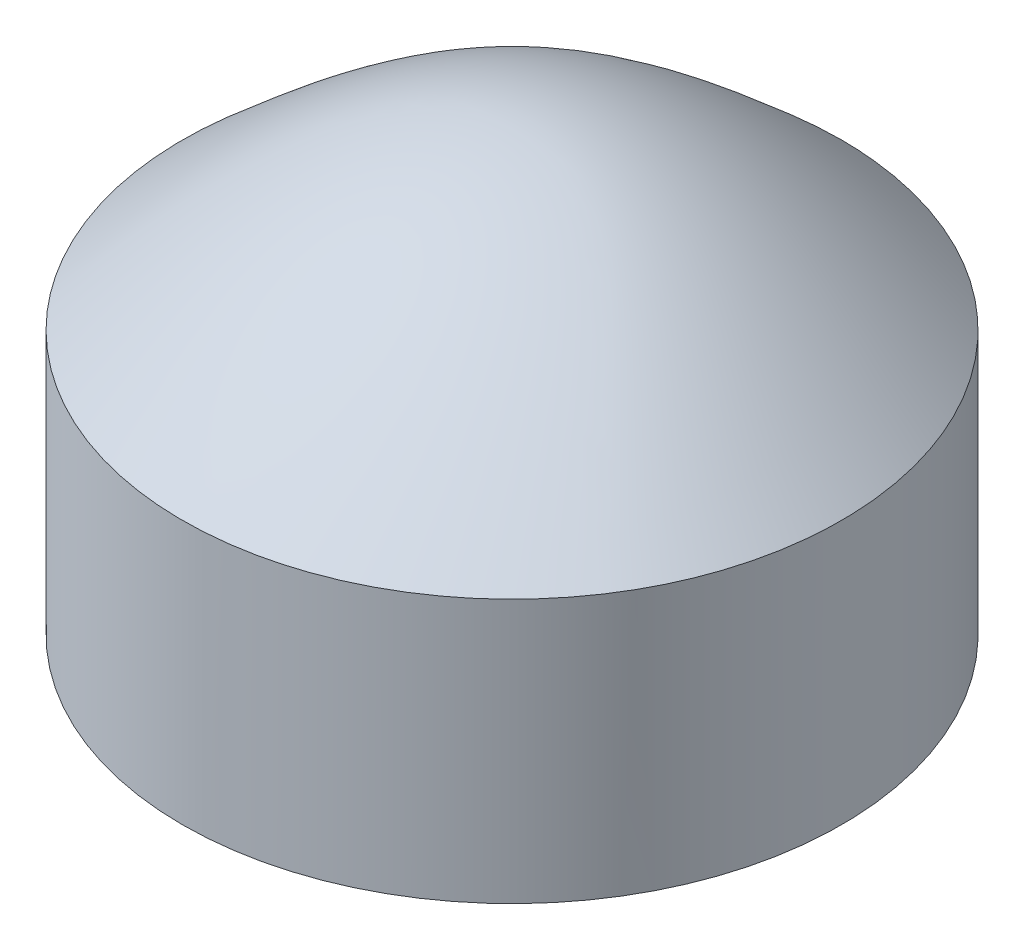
ISO-10303-21;
HEADER;
FILE_DESCRIPTION(('STEP AP214'),'2;1');
FILE_NAME('part.step','',(''),(''),'','','');
FILE_SCHEMA(('AUTOMOTIVE_DESIGN { 1 0 10303 214 1 1 1 1 }'));
ENDSEC;
DATA;
#1=APPLICATION_CONTEXT('core data for automotive mechanical design processes');
#2=APPLICATION_PROTOCOL_DEFINITION('international standard','automotive_design',2000,#1);
#3=PRODUCT_CONTEXT('',#1,'mechanical');
#4=PRODUCT('Part','Part','',(#3));
#5=PRODUCT_RELATED_PRODUCT_CATEGORY('part','',(#4));
#6=PRODUCT_DEFINITION_FORMATION('','',#4);
#7=PRODUCT_DEFINITION_CONTEXT('part definition',#1,'design');
#8=PRODUCT_DEFINITION('design','',#6,#7);
#9=PRODUCT_DEFINITION_SHAPE('','',#8);
#10=(LENGTH_UNIT() NAMED_UNIT(*) SI_UNIT(.MILLI.,.METRE.));
#11=(NAMED_UNIT(*) PLANE_ANGLE_UNIT() SI_UNIT($,.RADIAN.));
#12=(NAMED_UNIT(*) SI_UNIT($,.STERADIAN.) SOLID_ANGLE_UNIT());
#13=UNCERTAINTY_MEASURE_WITH_UNIT(LENGTH_MEASURE(1.E-05),#10,'distance_accuracy_value','');
#14=(GEOMETRIC_REPRESENTATION_CONTEXT(3) GLOBAL_UNCERTAINTY_ASSIGNED_CONTEXT((#13)) GLOBAL_UNIT_ASSIGNED_CONTEXT((#10,
#11,#12)) REPRESENTATION_CONTEXT('',''));
#15=CARTESIAN_POINT('',(0.,0.,0.));
#16=DIRECTION('',(0.,0.,1.));
#17=DIRECTION('',(1.,0.,0.));
#18=AXIS2_PLACEMENT_3D('',#15,#16,#17);
#19=CARTESIAN_POINT('',(0.,60.,0.));
#20=DIRECTION('',(0.,-1.,0.));
#21=DIRECTION('',(0.,0.,-1.));
#22=AXIS2_PLACEMENT_3D('',#19,#20,#21);
#23=CYLINDRICAL_SURFACE('',#22,75.);
#24=CARTESIAN_POINT('',(2.75821032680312E-13,60.0001773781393,-75.));
#25=CARTESIAN_POINT('',(-1.40454979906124,60.0001773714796,-74.9999993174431));
#26=CARTESIAN_POINT('',(-2.80911957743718,60.0001648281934,-74.9605336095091));
#27=CARTESIAN_POINT('',(-5.61420726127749,60.0001175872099,-74.8027715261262));
#28=CARTESIAN_POINT('',(-7.01472392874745,60.0000828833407,-74.684453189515));
#29=CARTESIAN_POINT('',(-9.80700357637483,59.9999995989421,-74.3693273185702));
#30=CARTESIAN_POINT('',(-11.1987659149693,59.9999510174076,-74.1725140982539));
#31=CARTESIAN_POINT('',(-13.9705882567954,59.9998517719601,-73.7007546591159));
#32=CARTESIAN_POINT('',(-15.3506334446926,59.9998011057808,-73.4257213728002));
#33=CARTESIAN_POINT('',(-18.0929706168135,59.9997106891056,-72.798508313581));
#34=CARTESIAN_POINT('',(-19.4552637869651,59.9996709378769,-72.4463337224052));
#35=CARTESIAN_POINT('',(-22.1579020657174,59.9996136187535,-71.6659295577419));
#36=CARTESIAN_POINT('',(-23.4982476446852,59.9995960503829,-71.2377016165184));
#37=CARTESIAN_POINT('',(-25.8203765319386,59.999590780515,-70.4231507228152));
#38=CARTESIAN_POINT('',(-26.8079298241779,59.9995967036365,-70.0531704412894));
#39=CARTESIAN_POINT('',(-28.7666432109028,59.9996256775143,-69.2718697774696));
#40=CARTESIAN_POINT('',(-29.7378022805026,59.9996487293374,-68.860546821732));
#41=CARTESIAN_POINT('',(-31.6618481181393,59.9997108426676,-67.9973463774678));
#42=CARTESIAN_POINT('',(-32.6147360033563,59.9997499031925,-67.5454713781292));
#43=CARTESIAN_POINT('',(-34.5007008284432,59.9998409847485,-66.601903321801));
#44=CARTESIAN_POINT('',(-35.4337759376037,59.9998930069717,-66.1102066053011));
#45=CARTESIAN_POINT('',(-37.2780421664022,60.0000053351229,-65.0880841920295));
#46=CARTESIAN_POINT('',(-38.1892407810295,60.000065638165,-64.5576720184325));
#47=CARTESIAN_POINT('',(-39.9885546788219,60.0001887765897,-63.4588593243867));
#48=CARTESIAN_POINT('',(-40.876667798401,60.0002516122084,-62.8904552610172));
#49=CARTESIAN_POINT('',(-42.6280579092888,60.0003735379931,-61.7167707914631));
#50=CARTESIAN_POINT('',(-43.4913373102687,60.0004326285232,-61.1114939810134));
#51=CARTESIAN_POINT('',(-45.1916951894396,60.000541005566,-59.8650316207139));
#52=CARTESIAN_POINT('',(-46.0287712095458,60.0005902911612,-59.223842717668));
#53=CARTESIAN_POINT('',(-47.6751601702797,60.0006738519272,-57.9067393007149));
#54=CARTESIAN_POINT('',(-48.4844727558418,60.000708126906,-57.2308243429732));
#55=CARTESIAN_POINT('',(-50.0739591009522,60.0007579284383,-55.8454132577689));
#56=CARTESIAN_POINT('',(-50.8541301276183,60.0007734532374,-55.1359139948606));
#57=CARTESIAN_POINT('',(-52.3837954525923,60.0007839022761,-53.6847215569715));
#58=CARTESIAN_POINT('',(-53.1332925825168,60.0007788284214,-52.9430313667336));
#59=CARTESIAN_POINT('',(-54.600422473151,60.0007483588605,-51.4286441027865));
#60=CARTESIAN_POINT('',(-55.3180522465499,60.0007229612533,-50.6559441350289));
#61=CARTESIAN_POINT('',(-56.7200591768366,60.0006542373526,-49.0810178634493));
#62=CARTESIAN_POINT('',(-57.4044381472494,60.0006109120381,-48.2787931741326));
#63=CARTESIAN_POINT('',(-58.738828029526,60.0005105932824,-46.6461335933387));
#64=CARTESIAN_POINT('',(-59.3888357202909,60.0004535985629,-45.8156960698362));
#65=CARTESIAN_POINT('',(-60.6532099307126,60.0003316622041,-44.1282157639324));
#66=CARTESIAN_POINT('',(-61.2675797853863,60.0002667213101,-43.2711754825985));
#67=CARTESIAN_POINT('',(-62.4596665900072,60.0001353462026,-41.5319406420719));
#68=CARTESIAN_POINT('',(-63.0373801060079,60.0000689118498,-40.6497437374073));
#69=CARTESIAN_POINT('',(-64.713814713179,59.9998776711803,-37.9679417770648));
#70=CARTESIAN_POINT('',(-65.7561946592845,59.9997608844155,-36.1326384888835));
#71=CARTESIAN_POINT('',(-67.682489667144,59.9995931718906,-32.3809917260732));
#72=CARTESIAN_POINT('',(-68.5664047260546,59.9995422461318,-30.4646482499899));
#73=CARTESIAN_POINT('',(-70.1696938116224,59.9995224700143,-26.5642476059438));
#74=CARTESIAN_POINT('',(-70.8890681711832,59.9995536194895,-24.5801905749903));
#75=CARTESIAN_POINT('',(-72.1581076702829,59.9996793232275,-20.5585453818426));
#76=CARTESIAN_POINT('',(-72.707772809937,59.9997738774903,-18.5209572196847));
#77=CARTESIAN_POINT('',(-73.6335020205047,59.9999812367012,-14.4067101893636));
#78=CARTESIAN_POINT('',(-74.0095657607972,60.0000940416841,-12.3300512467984));
#79=CARTESIAN_POINT('',(-74.5854130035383,60.0002860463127,-8.1524360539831));
#80=CARTESIAN_POINT('',(-74.7851965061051,60.0003652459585,-6.05147980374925));
#81=CARTESIAN_POINT('',(-75.0070638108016,60.0004541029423,-1.84020880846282));
#82=CARTESIAN_POINT('',(-75.0291479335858,60.0004637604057,0.270105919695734));
#83=CARTESIAN_POINT('',(-74.8954600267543,60.0004091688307,4.48509417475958));
#84=CARTESIAN_POINT('',(-74.7396879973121,60.0003449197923,6.58976770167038));
#85=CARTESIAN_POINT('',(-74.2513952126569,60.0001716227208,10.7785115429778));
#86=CARTESIAN_POINT('',(-73.9188743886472,60.0000625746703,12.8625818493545));
#87=CARTESIAN_POINT('',(-73.0794479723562,59.9998495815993,16.99530191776));
#88=CARTESIAN_POINT('',(-72.5725423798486,59.9997456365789,19.0439516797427));
#89=CARTESIAN_POINT('',(-71.3879495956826,59.9995917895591,23.0912681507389));
#90=CARTESIAN_POINT('',(-70.7102622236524,59.9995418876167,25.0899348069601));
#91=CARTESIAN_POINT('',(-69.1889240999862,59.9995226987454,29.0230734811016));
#92=CARTESIAN_POINT('',(-68.3452733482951,59.9995534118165,30.9575454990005));
#93=CARTESIAN_POINT('',(-66.4980066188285,59.9996878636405,34.7485413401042));
#94=CARTESIAN_POINT('',(-65.4943906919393,59.9997916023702,36.6050651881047));
#95=CARTESIAN_POINT('',(-63.334328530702,60.0000332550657,40.2269665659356));
#96=CARTESIAN_POINT('',(-62.1778822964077,60.0001711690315,41.9923440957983));
#97=CARTESIAN_POINT('',(-59.7203816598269,60.0004273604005,45.4194013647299));
#98=CARTESIAN_POINT('',(-58.4193273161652,60.0005456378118,47.081081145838));
#99=CARTESIAN_POINT('',(-55.6818597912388,60.000716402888,50.2889301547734));
#100=CARTESIAN_POINT('',(-54.2454466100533,60.000768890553,51.8350993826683));
#101=CARTESIAN_POINT('',(-51.2474732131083,60.0007887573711,54.800935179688));
#102=CARTESIAN_POINT('',(-49.6859129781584,60.0007561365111,56.2206017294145));
#103=CARTESIAN_POINT('',(-46.4487474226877,60.0006208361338,58.9233389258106));
#104=CARTESIAN_POINT('',(-44.7731421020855,60.0005181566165,60.2064095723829));
#105=CARTESIAN_POINT('',(-41.3197986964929,60.0002849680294,62.6268332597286));
#106=CARTESIAN_POINT('',(-39.5420605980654,60.000154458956,63.7641862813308));
#107=CARTESIAN_POINT('',(-35.8970904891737,59.9999164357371,65.8850886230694));
#108=CARTESIAN_POINT('',(-34.0298584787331,59.9998089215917,66.8686379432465));
#109=CARTESIAN_POINT('',(-30.2191755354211,59.9996545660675,68.6749403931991));
#110=CARTESIAN_POINT('',(-28.2757246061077,59.9996077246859,69.4976935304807));
#111=CARTESIAN_POINT('',(-24.326420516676,59.9995838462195,70.9765543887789));
#112=CARTESIAN_POINT('',(-22.3205673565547,59.9996068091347,71.632662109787));
#113=CARTESIAN_POINT('',(-18.2607193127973,59.9997006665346,72.7735675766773));
#114=CARTESIAN_POINT('',(-16.2067244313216,59.9997715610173,73.2583653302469));
#115=CARTESIAN_POINT('',(-12.0651955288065,59.9999197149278,74.0532042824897));
#116=CARTESIAN_POINT('',(-9.97766150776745,59.9999969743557,74.3632454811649));
#117=CARTESIAN_POINT('',(-5.78389545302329,60.0001164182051,74.8063671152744));
#118=CARTESIAN_POINT('',(-3.6776634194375,60.0001586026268,74.9394475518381));
#119=CARTESIAN_POINT('',(0.538524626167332,60.0001859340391,75.0277015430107));
#120=CARTESIAN_POINT('',(2.64848063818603,60.0001710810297,74.9828750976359));
#121=CARTESIAN_POINT('',(6.85711621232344,60.0000920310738,74.7156340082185));
#122=CARTESIAN_POINT('',(8.95579577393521,60.000027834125,74.4932193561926));
#123=CARTESIAN_POINT('',(13.1269579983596,59.9998838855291,73.8723830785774));
#124=CARTESIAN_POINT('',(15.1994406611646,59.9998041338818,73.4739614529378));
#125=CARTESIAN_POINT('',(19.3034750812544,59.9996732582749,72.5039437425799));
#126=CARTESIAN_POINT('',(21.3350268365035,59.9996221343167,71.9323476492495));
#127=CARTESIAN_POINT('',(25.3427562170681,59.9995822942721,70.620044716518));
#128=CARTESIAN_POINT('',(27.3189338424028,59.9995935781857,69.8793378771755));
#129=CARTESIAN_POINT('',(31.2018652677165,59.9996854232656,68.2340795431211));
#130=CARTESIAN_POINT('',(33.1086190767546,59.9997659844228,67.3295280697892));
#131=CARTESIAN_POINT('',(36.8391472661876,59.9999716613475,65.3630112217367));
#132=CARTESIAN_POINT('',(38.6629216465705,60.000096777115,64.3010458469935));
#133=CARTESIAN_POINT('',(42.2145247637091,60.0003447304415,62.0272513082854));
#134=CARTESIAN_POINT('',(43.9423535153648,60.000467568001,60.815422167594));
#135=CARTESIAN_POINT('',(47.2897818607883,60.0006617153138,58.2505153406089));
#136=CARTESIAN_POINT('',(48.9093814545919,60.0007330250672,56.8974376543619));
#137=CARTESIAN_POINT('',(52.0288377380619,60.0007938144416,54.0596527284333));
#138=CARTESIAN_POINT('',(53.5286943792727,60.0007832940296,52.5749454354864));
#139=CARTESIAN_POINT('',(56.3980009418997,60.0006827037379,49.484457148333));
#140=CARTESIAN_POINT('',(57.7674508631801,60.0005926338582,47.8786761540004));
#141=CARTESIAN_POINT('',(60.366208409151,60.0003675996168,44.5574561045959));
#142=CARTESIAN_POINT('',(61.5955159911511,60.0002326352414,42.8420170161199));
#143=CARTESIAN_POINT('',(63.905248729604,59.9999706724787,39.3136769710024));
#144=CARTESIAN_POINT('',(64.9856738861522,59.9998436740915,37.5007760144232));
#145=CARTESIAN_POINT('',(66.9899595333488,59.9996465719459,33.7904028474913));
#146=CARTESIAN_POINT('',(67.9138201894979,59.9995764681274,31.8929307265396));
#147=CARTESIAN_POINT('',(69.5984101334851,59.9995175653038,28.0269033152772));
#148=CARTESIAN_POINT('',(70.3591394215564,59.9995287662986,26.0583480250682));
#149=CARTESIAN_POINT('',(71.7120580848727,59.9996222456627,22.0641502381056));
#150=CARTESIAN_POINT('',(72.3042475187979,59.9997045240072,20.0385077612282));
#151=CARTESIAN_POINT('',(73.3158766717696,59.9999000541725,15.9445358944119));
#152=CARTESIAN_POINT('',(73.7353163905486,60.0000133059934,13.8762065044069));
#153=CARTESIAN_POINT('',(74.3984649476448,60.0002184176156,9.71156207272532));
#154=CARTESIAN_POINT('',(74.6421734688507,60.0003102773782,7.61524698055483));
#155=CARTESIAN_POINT('',(74.9521250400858,60.000430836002,3.4095366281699));
#156=CARTESIAN_POINT('',(75.0183680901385,60.000459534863,1.30014136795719));
#157=CARTESIAN_POINT('',(74.9729205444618,60.0004407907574,-2.91672224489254));
#158=CARTESIAN_POINT('',(74.8612302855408,60.0003933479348,-5.02419060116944));
#159=CARTESIAN_POINT('',(74.4607006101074,60.0002438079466,-9.22224592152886));
#160=CARTESIAN_POINT('',(74.1718611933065,60.000141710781,-11.3128328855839));
#161=CARTESIAN_POINT('',(73.4191239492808,59.9999293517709,-15.4621760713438));
#162=CARTESIAN_POINT('',(72.9552257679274,59.9998190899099,-17.520932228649));
#163=CARTESIAN_POINT('',(71.8555271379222,59.9996420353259,-21.5923116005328));
#164=CARTESIAN_POINT('',(71.2197266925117,59.9995752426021,-23.6049348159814));
#165=CARTESIAN_POINT('',(70.1407833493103,59.9995321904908,-26.5778755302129));
#166=CARTESIAN_POINT('',(69.7601980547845,59.9995273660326,-27.5613281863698));
#167=CARTESIAN_POINT('',(68.9579192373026,59.9995375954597,-29.511291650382));
#168=CARTESIAN_POINT('',(68.5362295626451,59.9995526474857,-30.4778040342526));
#169=CARTESIAN_POINT('',(67.6524434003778,59.9996017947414,-32.3922632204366));
#170=CARTESIAN_POINT('',(67.1903431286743,59.9996358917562,-33.3402082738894));
#171=CARTESIAN_POINT('',(66.2266303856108,59.9997200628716,-35.2156899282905));
#172=CARTESIAN_POINT('',(65.7250216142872,59.9997701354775,-36.1432284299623));
#173=CARTESIAN_POINT('',(64.6831192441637,59.9998814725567,-37.9763829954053));
#174=CARTESIAN_POINT('',(64.1428235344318,59.9999427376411,-38.8819978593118));
#175=CARTESIAN_POINT('',(63.024584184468,60.0000704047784,-40.6695603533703));
#176=CARTESIAN_POINT('',(62.4466440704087,60.0001368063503,-41.5515101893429));
#177=CARTESIAN_POINT('',(61.2540430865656,60.000268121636,-43.290342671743));
#178=CARTESIAN_POINT('',(60.6393788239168,60.0003330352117,-44.1472229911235));
#179=CARTESIAN_POINT('',(59.3745301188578,60.0004548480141,-45.8342287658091));
#180=CARTESIAN_POINT('',(58.7243490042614,60.0005117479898,-46.6643567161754));
#181=CARTESIAN_POINT('',(57.3895785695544,60.0006118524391,-48.2964553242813));
#182=CARTESIAN_POINT('',(56.7049896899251,60.0006550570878,-49.0984263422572));
#183=CARTESIAN_POINT('',(55.3026787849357,60.0007235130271,-50.6727228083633));
#184=CARTESIAN_POINT('',(54.584959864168,60.0007487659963,-51.4450510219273));
#185=CARTESIAN_POINT('',(53.1175337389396,60.0007789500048,-52.9588419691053));
#186=CARTESIAN_POINT('',(52.3678234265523,60.000783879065,-53.7003016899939));
#187=CARTESIAN_POINT('',(50.837884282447,60.0007731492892,-55.1508898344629));
#188=CARTESIAN_POINT('',(50.0576583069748,60.0007574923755,-55.8600212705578));
#189=CARTESIAN_POINT('',(48.4677319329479,60.0007074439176,-57.2450072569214));
#190=CARTESIAN_POINT('',(47.6580213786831,60.00067304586,-57.9208501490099));
#191=CARTESIAN_POINT('',(46.0109000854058,60.0005892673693,-59.2377310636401));
#192=CARTESIAN_POINT('',(45.1734919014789,60.0005398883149,-59.8787722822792));
#193=CARTESIAN_POINT('',(43.4723344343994,60.0004313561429,-61.1250188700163));
#194=CARTESIAN_POINT('',(42.6085835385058,60.0003722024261,-61.7302220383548));
#195=CARTESIAN_POINT('',(40.8564077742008,60.0002501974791,-62.9036225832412));
#196=CARTESIAN_POINT('',(39.967984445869,60.0001873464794,-63.4718222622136));
#197=CARTESIAN_POINT('',(37.8673672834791,60.0000436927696,-64.753689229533));
#198=CARTESIAN_POINT('',(36.6461154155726,59.9999639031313,-65.4525806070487));
#199=CARTESIAN_POINT('',(34.1662551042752,59.9998223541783,-66.7805777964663));
#200=CARTESIAN_POINT('',(32.907645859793,59.9997605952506,-67.4096821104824));
#201=CARTESIAN_POINT('',(30.3569477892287,59.9996643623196,-68.5961677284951));
#202=CARTESIAN_POINT('',(29.064856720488,59.9996298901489,-69.1535442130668));
#203=CARTESIAN_POINT('',(26.4528362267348,59.9995917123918,-70.1941711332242));
#204=CARTESIAN_POINT('',(25.1329394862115,59.9995879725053,-70.677503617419));
#205=CARTESIAN_POINT('',(22.468178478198,59.9996083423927,-71.569231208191));
#206=CARTESIAN_POINT('',(21.1233160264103,59.9996324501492,-71.9776317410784));
#207=CARTESIAN_POINT('',(18.4131422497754,59.9997002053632,-72.7181472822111));
#208=CARTESIAN_POINT('',(17.0478367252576,59.9997438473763,-73.0502835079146));
#209=CARTESIAN_POINT('',(14.3873162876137,59.9998357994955,-73.6188644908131));
#210=CARTESIAN_POINT('',(13.0931056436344,59.9998836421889,-73.8600201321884));
#211=CARTESIAN_POINT('',(10.4940676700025,59.9999754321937,-74.2738559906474));
#212=CARTESIAN_POINT('',(9.18924275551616,60.0000193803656,-74.4465513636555));
#213=CARTESIAN_POINT('',(6.57231482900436,60.000094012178,-74.7230611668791));
#214=CARTESIAN_POINT('',(5.26021181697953,60.0001246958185,-74.8268755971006));
#215=CARTESIAN_POINT('',(2.63207892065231,60.0001663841,-74.9653529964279));
#216=CARTESIAN_POINT('',(1.31604823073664,60.0001773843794,-75.0000006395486));
#217=CARTESIAN_POINT('',(2.75821032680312E-13,60.0001773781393,-75.));
#218=B_SPLINE_CURVE_WITH_KNOTS('',3,(#24,#25,#26,#27,#28,#29,#30,#31,#32,#33,#34,#35,#36,#37,
#38,#39,#40,#41,#42,#43,#44,#45,#46,#47,#48,#49,#50,#51,#52,#53,#54,#55,#56,#57,#58,#59,#60,#61,
#62,#63,#64,#65,#66,#67,#68,#69,#70,#71,#72,#73,#74,#75,#76,#77,#78,#79,#80,#81,#82,#83,#84,#85,
#86,#87,#88,#89,#90,#91,#92,#93,#94,#95,#96,#97,#98,#99,#100,#101,#102,#103,#104,#105,#106,#107,
#108,#109,#110,#111,#112,#113,#114,#115,#116,#117,#118,#119,#120,#121,#122,#123,#124,#125,#126,
#127,#128,#129,#130,#131,#132,#133,#134,#135,#136,#137,#138,#139,#140,#141,#142,#143,#144,#145,
#146,#147,#148,#149,#150,#151,#152,#153,#154,#155,#156,#157,#158,#159,#160,#161,#162,#163,#164,
#165,#166,#167,#168,#169,#170,#171,#172,#173,#174,#175,#176,#177,#178,#179,#180,#181,#182,#183,
#184,#185,#186,#187,#188,#189,#190,#191,#192,#193,#194,#195,#196,#197,#198,#199,#200,#201,#202,
#203,#204,#205,#206,#207,#208,#209,#210,#211,#212,#213,#214,#215,#216,#217),.UNSPECIFIED.,.T.,
.F.,(4,2,2,2,2,2,2,2,2,2,2,2,2,2,2,2,2,2,2,2,2,2,2,2,2,2,2,2,2,2,2,2,2,2,2,2,2,2,2,2,2,2,2,2,2,
2,2,2,2,2,2,2,2,2,2,2,2,2,2,2,2,2,2,2,2,2,2,2,2,2,2,2,2,2,2,2,2,2,2,2,2,2,2,2,2,2,2,2,2,2,2,2,2,
2,2,2,4),(0.,4.21313027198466,8.42743442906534,12.6420439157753,16.8613632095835,
21.0803991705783,25.2993445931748,28.4622153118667,31.6252830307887,34.788156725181,
37.9513214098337,41.1133864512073,44.2757467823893,47.4377992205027,50.6001474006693,
53.7625360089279,56.9252204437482,60.087612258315,63.2502998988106,66.4128148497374,
69.5756256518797,72.7381399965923,75.9009501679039,82.2247509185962,88.5485517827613,
94.8723398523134,101.196127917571,107.519928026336,113.843728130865,120.16751682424,
126.491305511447,132.815096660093,139.138887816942,145.462685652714,151.786483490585,
158.110279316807,164.4340751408,170.757868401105,177.081661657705,183.40545588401,
189.729250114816,196.053045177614,202.376840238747,208.700635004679,215.024429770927,
221.348224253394,227.672018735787,233.995813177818,240.319607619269,246.643402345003,
252.967197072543,259.290992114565,265.614787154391,271.938581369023,278.26237558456,
284.586168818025,290.909962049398,297.233757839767,303.557553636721,309.881351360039,
316.205149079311,322.5289401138,328.852731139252,335.176519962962,341.500308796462,
347.824109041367,354.147909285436,360.47169755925,366.79548584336,373.11928692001,
379.443087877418,382.605898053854,385.768412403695,388.931223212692,392.093738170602,
395.25642582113,398.418817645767,401.581502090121,404.743890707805,407.906238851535,
411.068291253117,414.230651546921,417.392716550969,420.555881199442,423.718754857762,
426.881822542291,430.044693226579,434.263638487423,438.482674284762,442.70199341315,
446.916602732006,451.13090672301,455.344036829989,459.291695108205,463.238478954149,
467.185262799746,471.132921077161),.UNSPECIFIED.);
#219=CARTESIAN_POINT('',(2.75821032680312E-13,60.0001773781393,-75.));
#220=VERTEX_POINT('',#219);
#221=EDGE_CURVE('E12',#220,#220,#218,.T.);
#222=ORIENTED_EDGE('',*,*,#221,.F.);
#223=EDGE_LOOP('',(#222));
#224=FACE_BOUND('',#223,.T.);
#225=CARTESIAN_POINT('',(0.,0.,0.));
#226=DIRECTION('',(0.,1.,0.));
#227=DIRECTION('',(0.,0.,1.));
#228=AXIS2_PLACEMENT_3D('',#225,#226,#227);
#229=CIRCLE('',#228,75.);
#230=CARTESIAN_POINT('',(0.,0.,75.));
#231=VERTEX_POINT('',#230);
#232=EDGE_CURVE('E423',#231,#231,#229,.T.);
#233=ORIENTED_EDGE('',*,*,#232,.T.);
#234=EDGE_LOOP('',(#233));
#235=FACE_BOUND('',#234,.T.);
#236=ADVANCED_FACE('F411',(#224,#235),#23,.T.);
#237=CARTESIAN_POINT('',(-77.1105881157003,27.9791721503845,-77.5017599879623));
#238=CARTESIAN_POINT('',(-77.1105881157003,48.6325296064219,-46.5010559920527));
#239=CARTESIAN_POINT('',(-77.1105881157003,65.9169627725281,-15.5003519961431));
#240=CARTESIAN_POINT('',(-77.1105881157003,65.9169625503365,15.5003519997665));
#241=CARTESIAN_POINT('',(-77.1105881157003,48.6325294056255,46.5010559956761));
#242=CARTESIAN_POINT('',(-77.1105881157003,27.9791722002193,77.5017599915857));
#243=CARTESIAN_POINT('',(-46.2663528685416,48.3500838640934,-77.5017599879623));
#244=CARTESIAN_POINT('',(-46.2663528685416,72.1851981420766,-46.5010559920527));
#245=CARTESIAN_POINT('',(-46.2663528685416,95.5567888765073,-15.5003519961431));
#246=CARTESIAN_POINT('',(-46.2663528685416,95.5567987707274,15.5003519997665));
#247=CARTESIAN_POINT('',(-46.2663528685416,72.1851945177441,46.5010559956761));
#248=CARTESIAN_POINT('',(-46.2663528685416,48.3500839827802,77.5017599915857));
#249=CARTESIAN_POINT('',(-15.4221176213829,65.493465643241,-77.5017599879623));
#250=CARTESIAN_POINT('',(-15.4221176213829,95.3734093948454,-46.5010559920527));
#251=CARTESIAN_POINT('',(-15.4221176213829,124.217084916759,-15.5003519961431));
#252=CARTESIAN_POINT('',(-15.4221176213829,124.217053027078,15.5003519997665));
#253=CARTESIAN_POINT('',(-15.4221176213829,95.3734213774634,46.5010559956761));
#254=CARTESIAN_POINT('',(-15.4221176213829,65.4934645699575,77.5017599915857));
#255=CARTESIAN_POINT('',(15.4221176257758,65.4934645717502,-77.5017599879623));
#256=CARTESIAN_POINT('',(15.4221176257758,95.3734213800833,-46.5010559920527));
#257=CARTESIAN_POINT('',(15.4221176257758,124.217053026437,-15.5003519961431));
#258=CARTESIAN_POINT('',(15.4221176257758,124.217084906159,15.5003519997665));
#259=CARTESIAN_POINT('',(15.4221176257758,95.3734093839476,46.5010559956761));
#260=CARTESIAN_POINT('',(15.4221176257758,65.4934656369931,77.5017599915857));
#261=CARTESIAN_POINT('',(46.2663528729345,48.3500839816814,-77.5017599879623));
#262=CARTESIAN_POINT('',(46.2663528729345,72.1851945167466,-46.5010559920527));
#263=CARTESIAN_POINT('',(46.2663528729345,95.5567987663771,-15.5003519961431));
#264=CARTESIAN_POINT('',(46.2663528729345,95.5567888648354,15.5003519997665));
#265=CARTESIAN_POINT('',(46.2663528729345,72.1851981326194,46.5010559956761));
#266=CARTESIAN_POINT('',(46.2663528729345,48.3500838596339,77.5017599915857));
#267=CARTESIAN_POINT('',(77.1105881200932,27.9791722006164,-77.5017599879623));
#268=CARTESIAN_POINT('',(77.1105881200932,48.6325294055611,-46.5010559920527));
#269=CARTESIAN_POINT('',(77.1105881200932,65.9169625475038,-15.5003519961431));
#270=CARTESIAN_POINT('',(77.1105881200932,65.9169627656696,15.5003519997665));
#271=CARTESIAN_POINT('',(77.1105881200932,48.6325296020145,46.5010559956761));
#272=CARTESIAN_POINT('',(77.1105881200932,27.9791721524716,77.5017599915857));
#273=B_SPLINE_SURFACE_WITH_KNOTS('',5,5,((#237,#238,#239,#240,#241,#242),(#243,#244,#245,#246,
#247,#248),(#249,#250,#251,#252,#253,#254),(#255,#256,#257,#258,#259,#260),(#261,#262,#263,#264,
#265,#266),(#267,#268,#269,#270,#271,#272)),.UNSPECIFIED.,.F.,.F.,.F.,(6,6),(6,6),
(-77.1105881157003,77.1105881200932),(-77.5017599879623,77.5017599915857),.UNSPECIFIED.);
#274=ORIENTED_EDGE('',*,*,#221,.T.);
#275=EDGE_LOOP('',(#274));
#276=FACE_BOUND('',#275,.T.);
#277=ADVANCED_FACE('F413',(#276),#273,.F.);
#278=CARTESIAN_POINT('',(0.,0.,0.));
#279=DIRECTION('',(0.,1.,0.));
#280=DIRECTION('',(0.,0.,1.));
#281=AXIS2_PLACEMENT_3D('',#278,#279,#280);
#282=PLANE('',#281);
#283=ORIENTED_EDGE('',*,*,#232,.F.);
#284=EDGE_LOOP('',(#283));
#285=FACE_BOUND('',#284,.T.);
#286=ADVANCED_FACE('F430',(#285),#282,.F.);
#287=CLOSED_SHELL('',(#236,#277,#286));
#288=MANIFOLD_SOLID_BREP('B2',#287);
#289=ADVANCED_BREP_SHAPE_REPRESENTATION('',(#18,#288),#14);
#290=SHAPE_DEFINITION_REPRESENTATION(#9,#289);
ENDSEC;
END-ISO-10303-21;
